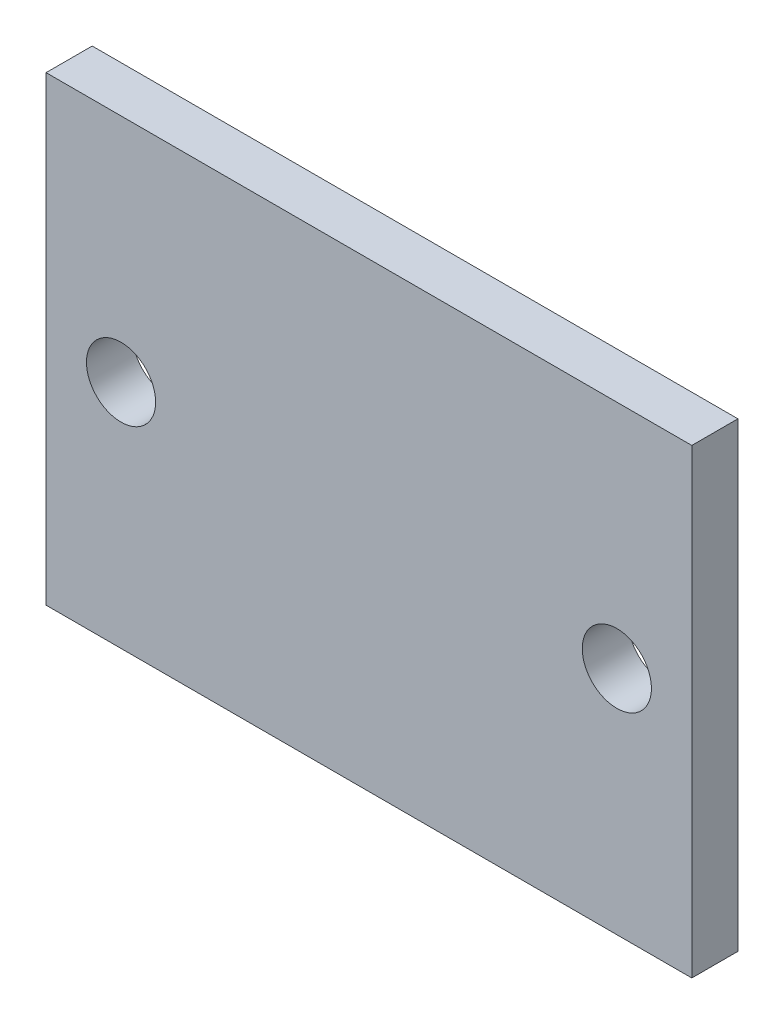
from build123d import *

# Parameters (mm, degrees)
CROQUIS1_W              = 28
CROQUIS1_H              = 20
SALIENTE_EXTRUIR1_DEPTH = 2
CORTAR_EXTRUIR1_REACH   = 19.321
CROQUIS2_R              = 1.5


with BuildPart() as part:
    # Croquis1 → Saliente-Extruir1 (new body)
    with BuildSketch(Plane.XY):
        Rectangle(CROQUIS1_W, CROQUIS1_H)
    extrude(amount=SALIENTE_EXTRUIR1_DEPTH)

    # Croquis2 → Cortar-Extruir1 (cut, up to next)
    with BuildSketch(Plane.XY.offset(2), mode=Mode.PRIVATE) as cortar_extruir1_sk1:
        with Locations((-10.75, 0)):
            Circle(CROQUIS2_R)
    cortar_extruir1_tool1 = extrude(cortar_extruir1_sk1.sketch, amount=-CORTAR_EXTRUIR1_REACH, mode=Mode.PRIVATE) & part.part
    # Croquis2 → Cortar-Extruir1 (cut, up to next)
    with BuildSketch(Plane.XY.offset(2), mode=Mode.PRIVATE) as cortar_extruir1_sk2:
        with Locations((10.75, 0)):
            Circle(CROQUIS2_R)
    cortar_extruir1_tool2 = extrude(cortar_extruir1_sk2.sketch, amount=-CORTAR_EXTRUIR1_REACH, mode=Mode.PRIVATE) & part.part
    add(cortar_extruir1_tool1.solids().sort_by_distance((-10.75, 0, 2))[0], mode=Mode.SUBTRACT)
    add(cortar_extruir1_tool2.solids().sort_by_distance((10.75, 0, 2))[0], mode=Mode.SUBTRACT)


solid = part.part
